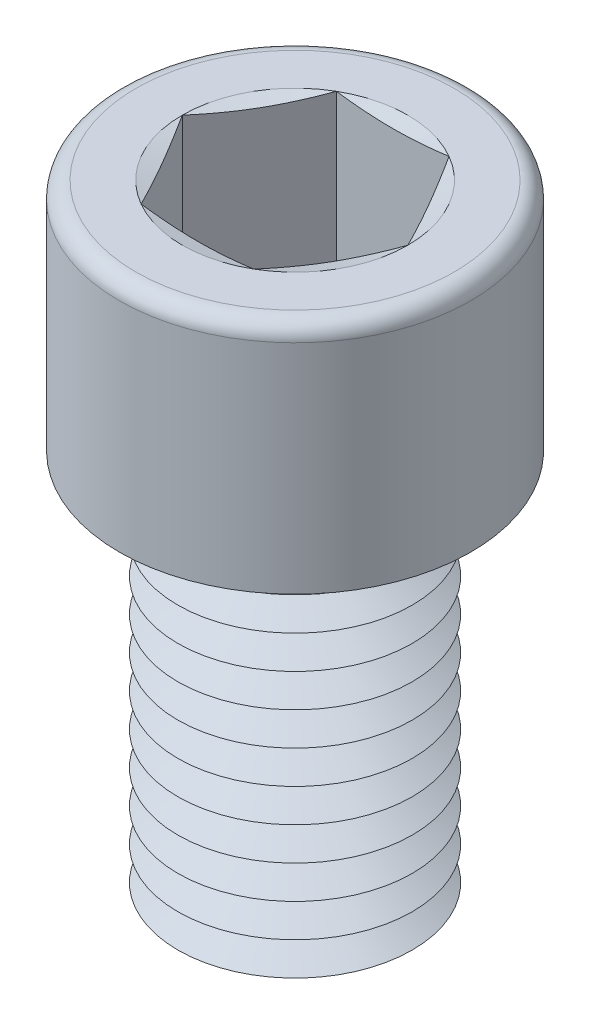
ISO-10303-21;
HEADER;
FILE_DESCRIPTION(('STEP AP214'),'2;1');
FILE_NAME('part.step','',(''),(''),'','','');
FILE_SCHEMA(('AUTOMOTIVE_DESIGN { 1 0 10303 214 1 1 1 1 }'));
ENDSEC;
DATA;
#1=APPLICATION_CONTEXT('core data for automotive mechanical design processes');
#2=APPLICATION_PROTOCOL_DEFINITION('international standard','automotive_design',2000,#1);
#3=PRODUCT_CONTEXT('',#1,'mechanical');
#4=PRODUCT('Part','Part','',(#3));
#5=PRODUCT_RELATED_PRODUCT_CATEGORY('part','',(#4));
#6=PRODUCT_DEFINITION_FORMATION('','',#4);
#7=PRODUCT_DEFINITION_CONTEXT('part definition',#1,'design');
#8=PRODUCT_DEFINITION('design','',#6,#7);
#9=PRODUCT_DEFINITION_SHAPE('','',#8);
#10=(LENGTH_UNIT() NAMED_UNIT(*) SI_UNIT(.MILLI.,.METRE.));
#11=(NAMED_UNIT(*) PLANE_ANGLE_UNIT() SI_UNIT($,.RADIAN.));
#12=(NAMED_UNIT(*) SI_UNIT($,.STERADIAN.) SOLID_ANGLE_UNIT());
#13=UNCERTAINTY_MEASURE_WITH_UNIT(LENGTH_MEASURE(1.E-05),#10,'distance_accuracy_value','');
#14=(GEOMETRIC_REPRESENTATION_CONTEXT(3) GLOBAL_UNCERTAINTY_ASSIGNED_CONTEXT((#13)) GLOBAL_UNIT_ASSIGNED_CONTEXT((#10,
#11,#12)) REPRESENTATION_CONTEXT('',''));
#15=CARTESIAN_POINT('',(0.,0.,0.));
#16=DIRECTION('',(0.,0.,1.));
#17=DIRECTION('',(1.,0.,0.));
#18=AXIS2_PLACEMENT_3D('',#15,#16,#17);
#19=CARTESIAN_POINT('',(0.,6.8,0.));
#20=DIRECTION('',(0.,1.,0.));
#21=DIRECTION('',(0.,0.,1.));
#22=AXIS2_PLACEMENT_3D('',#19,#20,#21);
#23=CONICAL_SURFACE('',#22,4.52775681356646,1.0471975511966);
#24=CARTESIAN_POINT('',(0.,7.65,0.));
#25=DIRECTION('',(0.,1.,0.));
#26=DIRECTION('',(0.,0.,1.));
#27=AXIS2_PLACEMENT_3D('',#24,#25,#26);
#28=CIRCLE('',#27,6.);
#29=CARTESIAN_POINT('',(0.,7.65,6.));
#30=VERTEX_POINT('',#29);
#31=EDGE_CURVE('E406',#30,#30,#28,.T.);
#32=ORIENTED_EDGE('',*,*,#31,.F.);
#33=EDGE_LOOP('',(#32));
#34=FACE_BOUND('',#33,.T.);
#35=CARTESIAN_POINT('',(0.,6.8,0.));
#36=DIRECTION('',(0.,1.,0.));
#37=DIRECTION('',(0.,0.,1.));
#38=AXIS2_PLACEMENT_3D('',#35,#36,#37);
#39=CIRCLE('',#38,4.52775681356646);
#40=CARTESIAN_POINT('',(0.,6.8,4.52775681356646));
#41=VERTEX_POINT('',#40);
#42=EDGE_CURVE('E409',#41,#41,#39,.T.);
#43=ORIENTED_EDGE('',*,*,#42,.T.);
#44=EDGE_LOOP('',(#43));
#45=FACE_BOUND('',#44,.T.);
#46=ADVANCED_FACE('F41',(#34,#45),#23,.T.);
#47=CARTESIAN_POINT('',(0.,5.95,0.));
#48=DIRECTION('',(0.,-1.,0.));
#49=DIRECTION('',(0.,0.,-1.));
#50=AXIS2_PLACEMENT_3D('',#47,#48,#49);
#51=CONICAL_SURFACE('',#50,6.,1.0471975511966);
#52=ORIENTED_EDGE('',*,*,#42,.F.);
#53=EDGE_LOOP('',(#52));
#54=FACE_BOUND('',#53,.T.);
#55=CARTESIAN_POINT('',(0.,5.95,0.));
#56=DIRECTION('',(0.,1.,0.));
#57=DIRECTION('',(0.,0.,1.));
#58=AXIS2_PLACEMENT_3D('',#55,#56,#57);
#59=CIRCLE('',#58,6.);
#60=CARTESIAN_POINT('',(0.,5.95,6.));
#61=VERTEX_POINT('',#60);
#62=EDGE_CURVE('E413',#61,#61,#59,.T.);
#63=ORIENTED_EDGE('',*,*,#62,.T.);
#64=EDGE_LOOP('',(#63));
#65=FACE_BOUND('',#64,.T.);
#66=ADVANCED_FACE('F250',(#54,#65),#51,.T.);
#67=CARTESIAN_POINT('',(0.,0.,0.));
#68=DIRECTION('',(0.,1.,0.));
#69=DIRECTION('',(0.,0.,1.));
#70=AXIS2_PLACEMENT_3D('',#67,#68,#69);
#71=PLANE('',#70);
#72=CARTESIAN_POINT('',(0.,0.,0.));
#73=DIRECTION('',(0.,1.,0.));
#74=DIRECTION('',(0.,0.,1.));
#75=AXIS2_PLACEMENT_3D('',#72,#73,#74);
#76=CIRCLE('',#75,4.52775681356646);
#77=CARTESIAN_POINT('',(0.,0.,4.52775681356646));
#78=VERTEX_POINT('',#77);
#79=EDGE_CURVE('E440',#78,#78,#76,.T.);
#80=ORIENTED_EDGE('',*,*,#79,.F.);
#81=EDGE_LOOP('',(#80));
#82=FACE_BOUND('',#81,.T.);
#83=ADVANCED_FACE('F247',(#82),#71,.F.);
#84=CARTESIAN_POINT('',(0.,0.,0.));
#85=DIRECTION('',(0.,1.,0.));
#86=DIRECTION('',(0.,0.,1.));
#87=AXIS2_PLACEMENT_3D('',#84,#85,#86);
#88=CONICAL_SURFACE('',#87,4.52775681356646,1.0471975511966);
#89=CARTESIAN_POINT('',(0.,0.85,0.));
#90=DIRECTION('',(0.,1.,0.));
#91=DIRECTION('',(0.,0.,1.));
#92=AXIS2_PLACEMENT_3D('',#89,#90,#91);
#93=CIRCLE('',#92,6.);
#94=CARTESIAN_POINT('',(0.,0.85,6.));
#95=VERTEX_POINT('',#94);
#96=EDGE_CURVE('E436',#95,#95,#93,.T.);
#97=ORIENTED_EDGE('',*,*,#96,.F.);
#98=EDGE_LOOP('',(#97));
#99=FACE_BOUND('',#98,.T.);
#100=ORIENTED_EDGE('',*,*,#79,.T.);
#101=EDGE_LOOP('',(#100));
#102=FACE_BOUND('',#101,.T.);
#103=ADVANCED_FACE('F249',(#99,#102),#88,.T.);
#104=CARTESIAN_POINT('',(0.,0.85,0.));
#105=DIRECTION('',(0.,-1.,0.));
#106=DIRECTION('',(0.,0.,-1.));
#107=AXIS2_PLACEMENT_3D('',#104,#105,#106);
#108=CONICAL_SURFACE('',#107,6.,1.0471975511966);
#109=CARTESIAN_POINT('',(0.,1.7,0.));
#110=DIRECTION('',(0.,1.,0.));
#111=DIRECTION('',(0.,0.,1.));
#112=AXIS2_PLACEMENT_3D('',#109,#110,#111);
#113=CIRCLE('',#112,4.52775681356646);
#114=CARTESIAN_POINT('',(0.,1.7,4.52775681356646));
#115=VERTEX_POINT('',#114);
#116=EDGE_CURVE('E432',#115,#115,#113,.T.);
#117=ORIENTED_EDGE('',*,*,#116,.F.);
#118=EDGE_LOOP('',(#117));
#119=FACE_BOUND('',#118,.T.);
#120=ORIENTED_EDGE('',*,*,#96,.T.);
#121=EDGE_LOOP('',(#120));
#122=FACE_BOUND('',#121,.T.);
#123=ADVANCED_FACE('F290',(#119,#122),#108,.T.);
#124=CARTESIAN_POINT('',(0.,1.7,0.));
#125=DIRECTION('',(0.,1.,0.));
#126=DIRECTION('',(0.,0.,1.));
#127=AXIS2_PLACEMENT_3D('',#124,#125,#126);
#128=CONICAL_SURFACE('',#127,4.52775681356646,1.0471975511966);
#129=CARTESIAN_POINT('',(0.,2.55,0.));
#130=DIRECTION('',(0.,1.,0.));
#131=DIRECTION('',(0.,0.,1.));
#132=AXIS2_PLACEMENT_3D('',#129,#130,#131);
#133=CIRCLE('',#132,6.);
#134=CARTESIAN_POINT('',(0.,2.55,6.));
#135=VERTEX_POINT('',#134);
#136=EDGE_CURVE('E428',#135,#135,#133,.T.);
#137=ORIENTED_EDGE('',*,*,#136,.F.);
#138=EDGE_LOOP('',(#137));
#139=FACE_BOUND('',#138,.T.);
#140=ORIENTED_EDGE('',*,*,#116,.T.);
#141=EDGE_LOOP('',(#140));
#142=FACE_BOUND('',#141,.T.);
#143=ADVANCED_FACE('F285',(#139,#142),#128,.T.);
#144=CARTESIAN_POINT('',(0.,2.55,0.));
#145=DIRECTION('',(0.,-1.,0.));
#146=DIRECTION('',(0.,0.,-1.));
#147=AXIS2_PLACEMENT_3D('',#144,#145,#146);
#148=CONICAL_SURFACE('',#147,6.,1.0471975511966);
#149=CARTESIAN_POINT('',(0.,3.4,0.));
#150=DIRECTION('',(0.,1.,0.));
#151=DIRECTION('',(0.,0.,1.));
#152=AXIS2_PLACEMENT_3D('',#149,#150,#151);
#153=CIRCLE('',#152,4.52775681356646);
#154=CARTESIAN_POINT('',(0.,3.4,4.52775681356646));
#155=VERTEX_POINT('',#154);
#156=EDGE_CURVE('E424',#155,#155,#153,.T.);
#157=ORIENTED_EDGE('',*,*,#156,.F.);
#158=EDGE_LOOP('',(#157));
#159=FACE_BOUND('',#158,.T.);
#160=ORIENTED_EDGE('',*,*,#136,.T.);
#161=EDGE_LOOP('',(#160));
#162=FACE_BOUND('',#161,.T.);
#163=ADVANCED_FACE('F282',(#159,#162),#148,.T.);
#164=CARTESIAN_POINT('',(0.,3.4,0.));
#165=DIRECTION('',(0.,1.,0.));
#166=DIRECTION('',(0.,0.,1.));
#167=AXIS2_PLACEMENT_3D('',#164,#165,#166);
#168=CONICAL_SURFACE('',#167,4.52775681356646,1.0471975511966);
#169=CARTESIAN_POINT('',(0.,4.25,0.));
#170=DIRECTION('',(0.,1.,0.));
#171=DIRECTION('',(0.,0.,1.));
#172=AXIS2_PLACEMENT_3D('',#169,#170,#171);
#173=CIRCLE('',#172,6.);
#174=CARTESIAN_POINT('',(0.,4.25,6.));
#175=VERTEX_POINT('',#174);
#176=EDGE_CURVE('E420',#175,#175,#173,.T.);
#177=ORIENTED_EDGE('',*,*,#176,.F.);
#178=EDGE_LOOP('',(#177));
#179=FACE_BOUND('',#178,.T.);
#180=ORIENTED_EDGE('',*,*,#156,.T.);
#181=EDGE_LOOP('',(#180));
#182=FACE_BOUND('',#181,.T.);
#183=ADVANCED_FACE('F276',(#179,#182),#168,.T.);
#184=CARTESIAN_POINT('',(0.,4.25,0.));
#185=DIRECTION('',(0.,-1.,0.));
#186=DIRECTION('',(0.,0.,-1.));
#187=AXIS2_PLACEMENT_3D('',#184,#185,#186);
#188=CONICAL_SURFACE('',#187,6.,1.0471975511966);
#189=CARTESIAN_POINT('',(0.,5.1,0.));
#190=DIRECTION('',(0.,1.,0.));
#191=DIRECTION('',(0.,0.,1.));
#192=AXIS2_PLACEMENT_3D('',#189,#190,#191);
#193=CIRCLE('',#192,4.52775681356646);
#194=CARTESIAN_POINT('',(0.,5.1,4.52775681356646));
#195=VERTEX_POINT('',#194);
#196=EDGE_CURVE('E416',#195,#195,#193,.T.);
#197=ORIENTED_EDGE('',*,*,#196,.F.);
#198=EDGE_LOOP('',(#197));
#199=FACE_BOUND('',#198,.T.);
#200=ORIENTED_EDGE('',*,*,#176,.T.);
#201=EDGE_LOOP('',(#200));
#202=FACE_BOUND('',#201,.T.);
#203=ADVANCED_FACE('F272',(#199,#202),#188,.T.);
#204=CARTESIAN_POINT('',(0.,5.1,0.));
#205=DIRECTION('',(0.,1.,0.));
#206=DIRECTION('',(0.,0.,1.));
#207=AXIS2_PLACEMENT_3D('',#204,#205,#206);
#208=CONICAL_SURFACE('',#207,4.52775681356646,1.0471975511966);
#209=ORIENTED_EDGE('',*,*,#62,.F.);
#210=EDGE_LOOP('',(#209));
#211=FACE_BOUND('',#210,.T.);
#212=ORIENTED_EDGE('',*,*,#196,.T.);
#213=EDGE_LOOP('',(#212));
#214=FACE_BOUND('',#213,.T.);
#215=ADVANCED_FACE('F275',(#211,#214),#208,.T.);
#216=CARTESIAN_POINT('',(0.,8.5,0.));
#217=DIRECTION('',(0.,1.,0.));
#218=DIRECTION('',(0.,0.,1.));
#219=AXIS2_PLACEMENT_3D('',#216,#217,#218);
#220=CONICAL_SURFACE('',#219,4.52775681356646,1.0471975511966);
#221=CARTESIAN_POINT('',(0.,9.35,0.));
#222=DIRECTION('',(0.,1.,0.));
#223=DIRECTION('',(0.,0.,1.));
#224=AXIS2_PLACEMENT_3D('',#221,#222,#223);
#225=CIRCLE('',#224,6.);
#226=CARTESIAN_POINT('',(0.,9.35,6.));
#227=VERTEX_POINT('',#226);
#228=EDGE_CURVE('E398',#227,#227,#225,.T.);
#229=ORIENTED_EDGE('',*,*,#228,.F.);
#230=EDGE_LOOP('',(#229));
#231=FACE_BOUND('',#230,.T.);
#232=CARTESIAN_POINT('',(0.,8.5,0.));
#233=DIRECTION('',(0.,1.,0.));
#234=DIRECTION('',(0.,0.,1.));
#235=AXIS2_PLACEMENT_3D('',#232,#233,#234);
#236=CIRCLE('',#235,4.52775681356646);
#237=CARTESIAN_POINT('',(0.,8.5,4.52775681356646));
#238=VERTEX_POINT('',#237);
#239=EDGE_CURVE('E402',#238,#238,#236,.T.);
#240=ORIENTED_EDGE('',*,*,#239,.T.);
#241=EDGE_LOOP('',(#240));
#242=FACE_BOUND('',#241,.T.);
#243=ADVANCED_FACE('F280',(#231,#242),#220,.T.);
#244=CARTESIAN_POINT('',(0.,7.65,0.));
#245=DIRECTION('',(0.,-1.,0.));
#246=DIRECTION('',(0.,0.,-1.));
#247=AXIS2_PLACEMENT_3D('',#244,#245,#246);
#248=CONICAL_SURFACE('',#247,6.,1.0471975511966);
#249=ORIENTED_EDGE('',*,*,#239,.F.);
#250=EDGE_LOOP('',(#249));
#251=FACE_BOUND('',#250,.T.);
#252=ORIENTED_EDGE('',*,*,#31,.T.);
#253=EDGE_LOOP('',(#252));
#254=FACE_BOUND('',#253,.T.);
#255=ADVANCED_FACE('F672',(#251,#254),#248,.T.);
#256=CARTESIAN_POINT('',(0.,10.2,0.));
#257=DIRECTION('',(0.,1.,0.));
#258=DIRECTION('',(0.,0.,1.));
#259=AXIS2_PLACEMENT_3D('',#256,#257,#258);
#260=CONICAL_SURFACE('',#259,4.52775681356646,1.0471975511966);
#261=CARTESIAN_POINT('',(0.,11.05,0.));
#262=DIRECTION('',(0.,1.,0.));
#263=DIRECTION('',(0.,0.,1.));
#264=AXIS2_PLACEMENT_3D('',#261,#262,#263);
#265=CIRCLE('',#264,6.);
#266=CARTESIAN_POINT('',(0.,11.05,6.));
#267=VERTEX_POINT('',#266);
#268=EDGE_CURVE('E390',#267,#267,#265,.T.);
#269=ORIENTED_EDGE('',*,*,#268,.F.);
#270=EDGE_LOOP('',(#269));
#271=FACE_BOUND('',#270,.T.);
#272=CARTESIAN_POINT('',(0.,10.2,0.));
#273=DIRECTION('',(0.,1.,0.));
#274=DIRECTION('',(0.,0.,1.));
#275=AXIS2_PLACEMENT_3D('',#272,#273,#274);
#276=CIRCLE('',#275,4.52775681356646);
#277=CARTESIAN_POINT('',(0.,10.2,4.52775681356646));
#278=VERTEX_POINT('',#277);
#279=EDGE_CURVE('E394',#278,#278,#276,.T.);
#280=ORIENTED_EDGE('',*,*,#279,.T.);
#281=EDGE_LOOP('',(#280));
#282=FACE_BOUND('',#281,.T.);
#283=ADVANCED_FACE('F681',(#271,#282),#260,.T.);
#284=CARTESIAN_POINT('',(0.,9.35,0.));
#285=DIRECTION('',(0.,-1.,0.));
#286=DIRECTION('',(0.,0.,-1.));
#287=AXIS2_PLACEMENT_3D('',#284,#285,#286);
#288=CONICAL_SURFACE('',#287,6.,1.0471975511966);
#289=ORIENTED_EDGE('',*,*,#279,.F.);
#290=EDGE_LOOP('',(#289));
#291=FACE_BOUND('',#290,.T.);
#292=ORIENTED_EDGE('',*,*,#228,.T.);
#293=EDGE_LOOP('',(#292));
#294=FACE_BOUND('',#293,.T.);
#295=ADVANCED_FACE('F691',(#291,#294),#288,.T.);
#296=CARTESIAN_POINT('',(0.,11.9,0.));
#297=DIRECTION('',(0.,1.,0.));
#298=DIRECTION('',(0.,0.,1.));
#299=AXIS2_PLACEMENT_3D('',#296,#297,#298);
#300=CONICAL_SURFACE('',#299,4.52775681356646,1.0471975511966);
#301=CARTESIAN_POINT('',(0.,12.75,0.));
#302=DIRECTION('',(0.,1.,0.));
#303=DIRECTION('',(0.,0.,1.));
#304=AXIS2_PLACEMENT_3D('',#301,#302,#303);
#305=CIRCLE('',#304,6.);
#306=CARTESIAN_POINT('',(0.,12.75,6.));
#307=VERTEX_POINT('',#306);
#308=EDGE_CURVE('E382',#307,#307,#305,.T.);
#309=ORIENTED_EDGE('',*,*,#308,.F.);
#310=EDGE_LOOP('',(#309));
#311=FACE_BOUND('',#310,.T.);
#312=CARTESIAN_POINT('',(0.,11.9,0.));
#313=DIRECTION('',(0.,1.,0.));
#314=DIRECTION('',(0.,0.,1.));
#315=AXIS2_PLACEMENT_3D('',#312,#313,#314);
#316=CIRCLE('',#315,4.52775681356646);
#317=CARTESIAN_POINT('',(0.,11.9,4.52775681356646));
#318=VERTEX_POINT('',#317);
#319=EDGE_CURVE('E386',#318,#318,#316,.T.);
#320=ORIENTED_EDGE('',*,*,#319,.T.);
#321=EDGE_LOOP('',(#320));
#322=FACE_BOUND('',#321,.T.);
#323=ADVANCED_FACE('F701',(#311,#322),#300,.T.);
#324=CARTESIAN_POINT('',(0.,11.05,0.));
#325=DIRECTION('',(0.,-1.,0.));
#326=DIRECTION('',(0.,0.,-1.));
#327=AXIS2_PLACEMENT_3D('',#324,#325,#326);
#328=CONICAL_SURFACE('',#327,6.,1.0471975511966);
#329=ORIENTED_EDGE('',*,*,#319,.F.);
#330=EDGE_LOOP('',(#329));
#331=FACE_BOUND('',#330,.T.);
#332=ORIENTED_EDGE('',*,*,#268,.T.);
#333=EDGE_LOOP('',(#332));
#334=FACE_BOUND('',#333,.T.);
#335=ADVANCED_FACE('F711',(#331,#334),#328,.T.);
#336=CARTESIAN_POINT('',(0.,13.6,0.));
#337=DIRECTION('',(0.,1.,0.));
#338=DIRECTION('',(0.,0.,1.));
#339=AXIS2_PLACEMENT_3D('',#336,#337,#338);
#340=CONICAL_SURFACE('',#339,4.52775681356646,1.0471975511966);
#341=CARTESIAN_POINT('',(0.,14.45,0.));
#342=DIRECTION('',(0.,1.,0.));
#343=DIRECTION('',(0.,0.,1.));
#344=AXIS2_PLACEMENT_3D('',#341,#342,#343);
#345=CIRCLE('',#344,6.);
#346=CARTESIAN_POINT('',(0.,14.45,6.));
#347=VERTEX_POINT('',#346);
#348=EDGE_CURVE('E374',#347,#347,#345,.T.);
#349=ORIENTED_EDGE('',*,*,#348,.F.);
#350=EDGE_LOOP('',(#349));
#351=FACE_BOUND('',#350,.T.);
#352=CARTESIAN_POINT('',(0.,13.6,0.));
#353=DIRECTION('',(0.,1.,0.));
#354=DIRECTION('',(0.,0.,1.));
#355=AXIS2_PLACEMENT_3D('',#352,#353,#354);
#356=CIRCLE('',#355,4.52775681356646);
#357=CARTESIAN_POINT('',(0.,13.6,4.52775681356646));
#358=VERTEX_POINT('',#357);
#359=EDGE_CURVE('E378',#358,#358,#356,.T.);
#360=ORIENTED_EDGE('',*,*,#359,.T.);
#361=EDGE_LOOP('',(#360));
#362=FACE_BOUND('',#361,.T.);
#363=ADVANCED_FACE('F721',(#351,#362),#340,.T.);
#364=CARTESIAN_POINT('',(0.,12.75,0.));
#365=DIRECTION('',(0.,-1.,0.));
#366=DIRECTION('',(0.,0.,-1.));
#367=AXIS2_PLACEMENT_3D('',#364,#365,#366);
#368=CONICAL_SURFACE('',#367,6.,1.0471975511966);
#369=ORIENTED_EDGE('',*,*,#359,.F.);
#370=EDGE_LOOP('',(#369));
#371=FACE_BOUND('',#370,.T.);
#372=ORIENTED_EDGE('',*,*,#308,.T.);
#373=EDGE_LOOP('',(#372));
#374=FACE_BOUND('',#373,.T.);
#375=ADVANCED_FACE('F731',(#371,#374),#368,.T.);
#376=CARTESIAN_POINT('',(0.,15.3,0.));
#377=DIRECTION('',(0.,1.,0.));
#378=DIRECTION('',(0.,0.,1.));
#379=AXIS2_PLACEMENT_3D('',#376,#377,#378);
#380=CONICAL_SURFACE('',#379,4.52775681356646,1.0471975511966);
#381=CARTESIAN_POINT('',(0.,16.15,0.));
#382=DIRECTION('',(0.,1.,0.));
#383=DIRECTION('',(0.,0.,1.));
#384=AXIS2_PLACEMENT_3D('',#381,#382,#383);
#385=CIRCLE('',#384,6.);
#386=CARTESIAN_POINT('',(0.,16.15,6.));
#387=VERTEX_POINT('',#386);
#388=EDGE_CURVE('E366',#387,#387,#385,.T.);
#389=ORIENTED_EDGE('',*,*,#388,.F.);
#390=EDGE_LOOP('',(#389));
#391=FACE_BOUND('',#390,.T.);
#392=CARTESIAN_POINT('',(0.,15.3,0.));
#393=DIRECTION('',(0.,1.,0.));
#394=DIRECTION('',(0.,0.,1.));
#395=AXIS2_PLACEMENT_3D('',#392,#393,#394);
#396=CIRCLE('',#395,4.52775681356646);
#397=CARTESIAN_POINT('',(0.,15.3,4.52775681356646));
#398=VERTEX_POINT('',#397);
#399=EDGE_CURVE('E370',#398,#398,#396,.T.);
#400=ORIENTED_EDGE('',*,*,#399,.T.);
#401=EDGE_LOOP('',(#400));
#402=FACE_BOUND('',#401,.T.);
#403=ADVANCED_FACE('F741',(#391,#402),#380,.T.);
#404=CARTESIAN_POINT('',(0.,14.45,0.));
#405=DIRECTION('',(0.,-1.,0.));
#406=DIRECTION('',(0.,0.,-1.));
#407=AXIS2_PLACEMENT_3D('',#404,#405,#406);
#408=CONICAL_SURFACE('',#407,6.,1.0471975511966);
#409=ORIENTED_EDGE('',*,*,#399,.F.);
#410=EDGE_LOOP('',(#409));
#411=FACE_BOUND('',#410,.T.);
#412=ORIENTED_EDGE('',*,*,#348,.T.);
#413=EDGE_LOOP('',(#412));
#414=FACE_BOUND('',#413,.T.);
#415=ADVANCED_FACE('F751',(#411,#414),#408,.T.);
#416=CARTESIAN_POINT('',(0.,17.,0.));
#417=DIRECTION('',(0.,1.,0.));
#418=DIRECTION('',(0.,0.,1.));
#419=AXIS2_PLACEMENT_3D('',#416,#417,#418);
#420=CONICAL_SURFACE('',#419,4.52775681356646,1.0471975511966);
#421=CARTESIAN_POINT('',(0.,17.85,0.));
#422=DIRECTION('',(0.,1.,0.));
#423=DIRECTION('',(0.,0.,1.));
#424=AXIS2_PLACEMENT_3D('',#421,#422,#423);
#425=CIRCLE('',#424,6.);
#426=CARTESIAN_POINT('',(0.,17.85,6.));
#427=VERTEX_POINT('',#426);
#428=EDGE_CURVE('E351',#427,#427,#425,.T.);
#429=ORIENTED_EDGE('',*,*,#428,.F.);
#430=EDGE_LOOP('',(#429));
#431=FACE_BOUND('',#430,.T.);
#432=CARTESIAN_POINT('',(0.,17.,0.));
#433=DIRECTION('',(0.,1.,0.));
#434=DIRECTION('',(0.,0.,1.));
#435=AXIS2_PLACEMENT_3D('',#432,#433,#434);
#436=CIRCLE('',#435,4.52775681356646);
#437=CARTESIAN_POINT('',(0.,17.,4.52775681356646));
#438=VERTEX_POINT('',#437);
#439=EDGE_CURVE('E362',#438,#438,#436,.T.);
#440=ORIENTED_EDGE('',*,*,#439,.T.);
#441=EDGE_LOOP('',(#440));
#442=FACE_BOUND('',#441,.T.);
#443=ADVANCED_FACE('F761',(#431,#442),#420,.T.);
#444=CARTESIAN_POINT('',(0.,16.15,0.));
#445=DIRECTION('',(0.,-1.,0.));
#446=DIRECTION('',(0.,0.,-1.));
#447=AXIS2_PLACEMENT_3D('',#444,#445,#446);
#448=CONICAL_SURFACE('',#447,6.,1.0471975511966);
#449=ORIENTED_EDGE('',*,*,#439,.F.);
#450=EDGE_LOOP('',(#449));
#451=FACE_BOUND('',#450,.T.);
#452=ORIENTED_EDGE('',*,*,#388,.T.);
#453=EDGE_LOOP('',(#452));
#454=FACE_BOUND('',#453,.T.);
#455=ADVANCED_FACE('F771',(#451,#454),#448,.T.);
#456=CARTESIAN_POINT('',(0.,18.7,0.));
#457=DIRECTION('',(0.,1.,0.));
#458=DIRECTION('',(0.,0.,1.));
#459=AXIS2_PLACEMENT_3D('',#456,#457,#458);
#460=CONICAL_SURFACE('',#459,4.52775681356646,1.0471975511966);
#461=CARTESIAN_POINT('',(0.,19.55,0.));
#462=DIRECTION('',(0.,1.,0.));
#463=DIRECTION('',(0.,0.,1.));
#464=AXIS2_PLACEMENT_3D('',#461,#462,#463);
#465=CIRCLE('',#464,6.);
#466=CARTESIAN_POINT('',(0.,19.55,6.));
#467=VERTEX_POINT('',#466);
#468=EDGE_CURVE('E357',#467,#467,#465,.T.);
#469=ORIENTED_EDGE('',*,*,#468,.F.);
#470=EDGE_LOOP('',(#469));
#471=FACE_BOUND('',#470,.T.);
#472=CARTESIAN_POINT('',(0.,18.7,0.));
#473=DIRECTION('',(0.,1.,0.));
#474=DIRECTION('',(0.,0.,1.));
#475=AXIS2_PLACEMENT_3D('',#472,#473,#474);
#476=CIRCLE('',#475,4.52775681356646);
#477=CARTESIAN_POINT('',(0.,18.7,4.52775681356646));
#478=VERTEX_POINT('',#477);
#479=EDGE_CURVE('E347',#478,#478,#476,.T.);
#480=ORIENTED_EDGE('',*,*,#479,.T.);
#481=EDGE_LOOP('',(#480));
#482=FACE_BOUND('',#481,.T.);
#483=ADVANCED_FACE('F781',(#471,#482),#460,.T.);
#484=CARTESIAN_POINT('',(0.,17.85,0.));
#485=DIRECTION('',(0.,-1.,0.));
#486=DIRECTION('',(0.,0.,-1.));
#487=AXIS2_PLACEMENT_3D('',#484,#485,#486);
#488=CONICAL_SURFACE('',#487,6.,1.0471975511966);
#489=ORIENTED_EDGE('',*,*,#479,.F.);
#490=EDGE_LOOP('',(#489));
#491=FACE_BOUND('',#490,.T.);
#492=ORIENTED_EDGE('',*,*,#428,.T.);
#493=EDGE_LOOP('',(#492));
#494=FACE_BOUND('',#493,.T.);
#495=ADVANCED_FACE('F194',(#491,#494),#488,.T.);
#496=CARTESIAN_POINT('',(0.,32.,0.));
#497=DIRECTION('',(0.,1.,0.));
#498=DIRECTION('',(0.,0.,1.));
#499=AXIS2_PLACEMENT_3D('',#496,#497,#498);
#500=PLANE('',#499);
#501=CARTESIAN_POINT('',(0.,32.,0.));
#502=DIRECTION('',(0.,1.,0.));
#503=DIRECTION('',(0.,0.,1.));
#504=AXIS2_PLACEMENT_3D('',#501,#502,#503);
#505=CIRCLE('',#504,5.77350269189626);
#506=CARTESIAN_POINT('',(2.88675134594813,32.,5.));
#507=VERTEX_POINT('',#506);
#508=CARTESIAN_POINT('',(5.77350269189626,32.,0.));
#509=VERTEX_POINT('',#508);
#510=EDGE_CURVE('E121',#507,#509,#505,.T.);
#511=ORIENTED_EDGE('',*,*,#510,.F.);
#512=CARTESIAN_POINT('',(0.,32.,0.));
#513=DIRECTION('',(0.,1.,0.));
#514=DIRECTION('',(0.,0.,1.));
#515=AXIS2_PLACEMENT_3D('',#512,#513,#514);
#516=CIRCLE('',#515,5.77350269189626);
#517=CARTESIAN_POINT('',(-2.88675134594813,32.,5.));
#518=VERTEX_POINT('',#517);
#519=EDGE_CURVE('E45',#518,#507,#516,.T.);
#520=ORIENTED_EDGE('',*,*,#519,.F.);
#521=CARTESIAN_POINT('',(-5.77350269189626,32.,0.));
#522=VERTEX_POINT('',#521);
#523=EDGE_CURVE('E138',#522,#518,#516,.T.);
#524=ORIENTED_EDGE('',*,*,#523,.F.);
#525=CARTESIAN_POINT('',(-2.88675134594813,32.,-5.));
#526=VERTEX_POINT('',#525);
#527=EDGE_CURVE('E513',#526,#522,#516,.T.);
#528=ORIENTED_EDGE('',*,*,#527,.F.);
#529=CARTESIAN_POINT('',(2.88675134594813,32.,-5.));
#530=VERTEX_POINT('',#529);
#531=EDGE_CURVE('E51',#530,#526,#516,.T.);
#532=ORIENTED_EDGE('',*,*,#531,.F.);
#533=EDGE_CURVE('E11',#509,#530,#516,.T.);
#534=ORIENTED_EDGE('',*,*,#533,.F.);
#535=EDGE_LOOP('',(#511,#520,#524,#528,#532,#534));
#536=FACE_BOUND('',#535,.T.);
#537=CARTESIAN_POINT('',(0.,32.,0.));
#538=DIRECTION('',(0.,1.,0.));
#539=DIRECTION('',(0.,0.,1.));
#540=AXIS2_PLACEMENT_3D('',#537,#538,#539);
#541=CIRCLE('',#540,8.15);
#542=CARTESIAN_POINT('',(0.,32.,8.15));
#543=VERTEX_POINT('',#542);
#544=EDGE_CURVE('E484',#543,#543,#541,.T.);
#545=ORIENTED_EDGE('',*,*,#544,.T.);
#546=EDGE_LOOP('',(#545));
#547=FACE_BOUND('',#546,.T.);
#548=ADVANCED_FACE('F140',(#536,#547),#500,.T.);
#549=CARTESIAN_POINT('',(0.,31.15,0.));
#550=DIRECTION('',(0.,1.,0.));
#551=DIRECTION('',(0.,0.,1.));
#552=AXIS2_PLACEMENT_3D('',#549,#550,#551);
#553=TOROIDAL_SURFACE('',#552,8.15,0.85);
#554=CARTESIAN_POINT('',(0.,31.15,0.));
#555=DIRECTION('',(0.,1.,0.));
#556=DIRECTION('',(0.,0.,1.));
#557=AXIS2_PLACEMENT_3D('',#554,#555,#556);
#558=CIRCLE('',#557,9.);
#559=CARTESIAN_POINT('',(0.,31.15,9.));
#560=VERTEX_POINT('',#559);
#561=EDGE_CURVE('E488',#560,#560,#558,.F.);
#562=ORIENTED_EDGE('',*,*,#561,.F.);
#563=EDGE_LOOP('',(#562));
#564=FACE_BOUND('',#563,.T.);
#565=ORIENTED_EDGE('',*,*,#544,.F.);
#566=EDGE_LOOP('',(#565));
#567=FACE_BOUND('',#566,.T.);
#568=ADVANCED_FACE('F43',(#564,#567),#553,.T.);
#569=CARTESIAN_POINT('',(0.,32.,0.));
#570=DIRECTION('',(0.,-1.,0.));
#571=DIRECTION('',(0.,0.,-1.));
#572=AXIS2_PLACEMENT_3D('',#569,#570,#571);
#573=CYLINDRICAL_SURFACE('',#572,9.);
#574=ORIENTED_EDGE('',*,*,#561,.T.);
#575=EDGE_LOOP('',(#574));
#576=FACE_BOUND('',#575,.T.);
#577=CARTESIAN_POINT('',(0.,20.,0.));
#578=DIRECTION('',(0.,1.,0.));
#579=DIRECTION('',(0.,0.,1.));
#580=AXIS2_PLACEMENT_3D('',#577,#578,#579);
#581=CIRCLE('',#580,9.);
#582=CARTESIAN_POINT('',(0.,20.,9.));
#583=VERTEX_POINT('',#582);
#584=EDGE_CURVE('E471',#583,#583,#581,.T.);
#585=ORIENTED_EDGE('',*,*,#584,.T.);
#586=EDGE_LOOP('',(#585));
#587=FACE_BOUND('',#586,.T.);
#588=ADVANCED_FACE('F242',(#576,#587),#573,.T.);
#589=CARTESIAN_POINT('',(0.,20.,0.));
#590=DIRECTION('',(0.,1.,0.));
#591=DIRECTION('',(0.,0.,1.));
#592=AXIS2_PLACEMENT_3D('',#589,#590,#591);
#593=PLANE('',#592);
#594=ORIENTED_EDGE('',*,*,#584,.F.);
#595=EDGE_LOOP('',(#594));
#596=FACE_BOUND('',#595,.T.);
#597=CARTESIAN_POINT('',(0.,20.,0.));
#598=DIRECTION('',(0.,1.,0.));
#599=DIRECTION('',(0.,0.,1.));
#600=AXIS2_PLACEMENT_3D('',#597,#598,#599);
#601=CIRCLE('',#600,6.);
#602=CARTESIAN_POINT('',(0.,20.,6.));
#603=VERTEX_POINT('',#602);
#604=EDGE_CURVE('E480',#603,#603,#601,.T.);
#605=ORIENTED_EDGE('',*,*,#604,.T.);
#606=EDGE_LOOP('',(#605));
#607=FACE_BOUND('',#606,.T.);
#608=ADVANCED_FACE('F238',(#596,#607),#593,.F.);
#609=CARTESIAN_POINT('',(0.,20.,0.));
#610=DIRECTION('',(0.,-1.,0.));
#611=DIRECTION('',(0.,0.,-1.));
#612=AXIS2_PLACEMENT_3D('',#609,#610,#611);
#613=CYLINDRICAL_SURFACE('',#612,6.);
#614=ORIENTED_EDGE('',*,*,#468,.T.);
#615=EDGE_LOOP('',(#614));
#616=FACE_BOUND('',#615,.T.);
#617=ORIENTED_EDGE('',*,*,#604,.F.);
#618=EDGE_LOOP('',(#617));
#619=FACE_BOUND('',#618,.T.);
#620=ADVANCED_FACE('F241',(#616,#619),#613,.T.);
#621=CARTESIAN_POINT('',(0.,32.,0.));
#622=DIRECTION('',(0.,1.,0.));
#623=DIRECTION('',(0.,0.,1.));
#624=AXIS2_PLACEMENT_3D('',#621,#622,#623);
#625=CONICAL_SURFACE('',#624,5.77350269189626,1.30899693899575);
#626=ORIENTED_EDGE('',*,*,#519,.T.);
#627=CARTESIAN_POINT('',(-7.53601896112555,32.8762922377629,5.));
#628=CARTESIAN_POINT('',(-7.31024491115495,32.8258964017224,5.));
#629=CARTESIAN_POINT('',(-7.08432679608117,32.7761341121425,5.));
#630=CARTESIAN_POINT('',(-6.6321318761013,32.6782185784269,5.));
#631=CARTESIAN_POINT('',(-6.40585505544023,32.6300654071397,5.));
#632=CARTESIAN_POINT('',(-5.95265829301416,32.5356658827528,5.));
#633=CARTESIAN_POINT('',(-5.72573792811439,32.4894215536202,5.));
#634=CARTESIAN_POINT('',(-5.27141735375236,32.3993548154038,5.));
#635=CARTESIAN_POINT('',(-5.04401714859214,32.3555323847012,5.));
#636=CARTESIAN_POINT('',(-4.59062882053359,32.2712514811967,5.));
#637=CARTESIAN_POINT('',(-4.36464552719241,32.2307671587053,5.));
#638=CARTESIAN_POINT('',(-3.91205719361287,32.1534441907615,5.));
#639=CARTESIAN_POINT('',(-3.68545216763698,32.1166054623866,5.));
#640=CARTESIAN_POINT('',(-3.23158610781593,32.0474235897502,5.));
#641=CARTESIAN_POINT('',(-3.0043251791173,32.0150797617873,5.));
#642=CARTESIAN_POINT('',(-2.54908400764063,31.9558588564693,5.));
#643=CARTESIAN_POINT('',(-2.32110376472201,31.9289817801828,5.));
#644=CARTESIAN_POINT('',(-1.86187954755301,31.8814746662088,5.));
#645=CARTESIAN_POINT('',(-1.63062780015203,31.8609186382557,5.));
#646=CARTESIAN_POINT('',(-1.16756520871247,31.827486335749,5.));
#647=CARTESIAN_POINT('',(-0.935754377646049,31.8146098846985,5.));
#648=CARTESIAN_POINT('',(-0.471911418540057,31.7972884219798,5.));
#649=CARTESIAN_POINT('',(-0.239879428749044,31.7928397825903,5.));
#650=CARTESIAN_POINT('',(0.224188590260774,31.7926446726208,5.));
#651=CARTESIAN_POINT('',(0.456224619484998,31.7968982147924,5.));
#652=CARTESIAN_POINT('',(0.920927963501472,31.8138725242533,5.));
#653=CARTESIAN_POINT('',(1.15359399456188,31.826627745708,5.));
#654=CARTESIAN_POINT('',(1.61837361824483,31.8598918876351,5.));
#655=CARTESIAN_POINT('',(1.85048718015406,31.8804012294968,5.));
#656=CARTESIAN_POINT('',(2.31415649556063,31.9281624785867,5.));
#657=CARTESIAN_POINT('',(2.54571180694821,31.9554186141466,5.));
#658=CARTESIAN_POINT('',(3.00808011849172,32.0155697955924,5.));
#659=CARTESIAN_POINT('',(3.23889311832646,32.048464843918,5.));
#660=CARTESIAN_POINT('',(3.70583783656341,32.1197908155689,5.));
#661=CARTESIAN_POINT('',(3.94195070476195,32.1583440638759,5.));
#662=CARTESIAN_POINT('',(4.41350709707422,32.2393601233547,5.));
#663=CARTESIAN_POINT('',(4.6489506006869,32.2818230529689,5.));
#664=CARTESIAN_POINT('',(5.11927632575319,32.3698836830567,5.));
#665=CARTESIAN_POINT('',(5.35415847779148,32.4154817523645,5.));
#666=CARTESIAN_POINT('',(5.82342156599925,32.5091942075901,5.));
#667=CARTESIAN_POINT('',(6.05780249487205,32.5573086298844,5.));
#668=CARTESIAN_POINT('',(6.76045918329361,32.7046977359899,5.));
#669=CARTESIAN_POINT('',(7.22810106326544,32.8069899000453,5.));
#670=CARTESIAN_POINT('',(8.16214602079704,33.0168686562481,5.));
#671=CARTESIAN_POINT('',(8.62854918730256,33.1244548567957,5.));
#672=CARTESIAN_POINT('',(9.55483040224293,33.3419500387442,5.));
#673=CARTESIAN_POINT('',(10.0147188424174,33.4518148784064,5.));
#674=CARTESIAN_POINT('',(10.9338908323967,33.6740840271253,5.));
#675=CARTESIAN_POINT('',(11.3931743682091,33.78648839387,5.));
#676=CARTESIAN_POINT('',(12.3106437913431,34.0129904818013,5.));
#677=CARTESIAN_POINT('',(12.7688303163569,34.1270856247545,5.));
#678=CARTESIAN_POINT('',(13.6848325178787,34.3566862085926,5.));
#679=CARTESIAN_POINT('',(14.142648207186,34.4721915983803,5.));
#680=CARTESIAN_POINT('',(14.6003379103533,34.5881883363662,5.));
#681=B_SPLINE_CURVE_WITH_KNOTS('',3,(#627,#628,#629,#630,#631,#632,#633,#634,#635,#636,#637,
#638,#639,#640,#641,#642,#643,#644,#645,#646,#647,#648,#649,#650,#651,#652,#653,#654,#655,#656,
#657,#658,#659,#660,#661,#662,#663,#664,#665,#666,#667,#668,#669,#670,#671,#672,#673,#674,#675,
#676,#677,#678,#679,#680),.UNSPECIFIED.,.F.,.F.,(4,2,2,2,2,2,2,2,2,2,2,2,2,2,2,2,2,2,2,2,2,2,2,
2,2,2,4),(0.,0.693993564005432,1.38801850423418,2.08276135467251,2.7774980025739,
3.46621708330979,4.15492049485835,4.8435190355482,5.5321177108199,6.228496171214,
6.9248586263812,7.62092126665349,8.31698492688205,9.01588676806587,9.71482659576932,
10.4142055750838,11.113584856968,11.8312632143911,12.5489633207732,13.2667480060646,
13.9845430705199,15.4205845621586,16.85651998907,18.2749978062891,19.6935078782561,
21.1100410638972,22.5265230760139),.UNSPECIFIED.);
#682=EDGE_CURVE('E127',#518,#507,#681,.T.);
#683=ORIENTED_EDGE('',*,*,#682,.F.);
#684=EDGE_LOOP('',(#626,#683));
#685=FACE_BOUND('',#684,.T.);
#686=ADVANCED_FACE('F132',(#685),#625,.F.);
#687=ORIENTED_EDGE('',*,*,#523,.T.);
#688=CARTESIAN_POINT('',(-5.7736181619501,32.0000309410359,-0.000200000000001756));
#689=CARTESIAN_POINT('',(-5.65372906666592,31.9678926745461,0.207454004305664));
#690=CARTESIAN_POINT('',(-5.53362259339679,31.9387163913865,0.415484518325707));
#691=CARTESIAN_POINT('',(-5.29298546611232,31.8874563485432,0.832280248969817));
#692=CARTESIAN_POINT('',(-5.17245465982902,31.8653754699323,1.04104572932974));
#693=CARTESIAN_POINT('',(-4.93169967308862,31.8295953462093,1.45804559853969));
#694=CARTESIAN_POINT('',(-4.81147712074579,31.8158534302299,1.66627716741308));
#695=CARTESIAN_POINT('',(-4.57087869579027,31.7974269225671,2.08300586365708));
#696=CARTESIAN_POINT('',(-4.45050285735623,31.7927405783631,2.29150293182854));
#697=CARTESIAN_POINT('',(-4.20975118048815,31.7927405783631,2.70849706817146));
#698=CARTESIAN_POINT('',(-4.08937534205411,31.7974269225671,2.91699413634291));
#699=CARTESIAN_POINT('',(-3.8487769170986,31.8158534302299,3.33372283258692));
#700=CARTESIAN_POINT('',(-3.72855436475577,31.8295953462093,3.54195440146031));
#701=CARTESIAN_POINT('',(-3.48779937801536,31.8653754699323,3.95895427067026));
#702=CARTESIAN_POINT('',(-3.36726857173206,31.8874563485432,4.16771975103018));
#703=CARTESIAN_POINT('',(-3.1266314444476,31.9387163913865,4.58451548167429));
#704=CARTESIAN_POINT('',(-3.00652497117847,31.9678926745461,4.79254599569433));
#705=CARTESIAN_POINT('',(-2.88663587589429,32.0000309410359,5.0002));
#706=B_SPLINE_CURVE_WITH_KNOTS('',3,(#688,#689,#690,#691,#692,#693,#694,#695,#696,#697,#698,
#699,#700,#701,#702,#703,#704,#705),.UNSPECIFIED.,.F.,.F.,(4,2,2,2,2,2,2,2,4),(0.,
0.725805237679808,1.45190481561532,2.17425686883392,2.89646911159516,3.6186813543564,
4.34103340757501,5.06713298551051,5.79293822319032),.UNSPECIFIED.);
#707=EDGE_CURVE('E163',#522,#518,#706,.T.);
#708=ORIENTED_EDGE('',*,*,#707,.F.);
#709=EDGE_LOOP('',(#687,#708));
#710=FACE_BOUND('',#709,.T.);
#711=ADVANCED_FACE('F257',(#710),#625,.F.);
#712=ORIENTED_EDGE('',*,*,#527,.T.);
#713=CARTESIAN_POINT('',(-2.88663587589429,32.0000309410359,-5.0002));
#714=CARTESIAN_POINT('',(-3.00652497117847,31.9678926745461,-4.79254599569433));
#715=CARTESIAN_POINT('',(-3.1266314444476,31.9387163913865,-4.58451548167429));
#716=CARTESIAN_POINT('',(-3.36726857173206,31.8874563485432,-4.16771975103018));
#717=CARTESIAN_POINT('',(-3.48779937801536,31.8653754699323,-3.95895427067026));
#718=CARTESIAN_POINT('',(-3.72855436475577,31.8295953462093,-3.54195440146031));
#719=CARTESIAN_POINT('',(-3.8487769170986,31.8158534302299,-3.33372283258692));
#720=CARTESIAN_POINT('',(-4.08937534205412,31.797426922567,-2.91699413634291));
#721=CARTESIAN_POINT('',(-4.20975118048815,31.7927405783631,-2.70849706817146));
#722=CARTESIAN_POINT('',(-4.45050285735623,31.7927405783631,-2.29150293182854));
#723=CARTESIAN_POINT('',(-4.57087869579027,31.797426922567,-2.08300586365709));
#724=CARTESIAN_POINT('',(-4.81147712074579,31.8158534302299,-1.66627716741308));
#725=CARTESIAN_POINT('',(-4.93169967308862,31.8295953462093,-1.45804559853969));
#726=CARTESIAN_POINT('',(-5.17245465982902,31.8653754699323,-1.04104572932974));
#727=CARTESIAN_POINT('',(-5.29298546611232,31.8874563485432,-0.832280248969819));
#728=CARTESIAN_POINT('',(-5.53362259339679,31.9387163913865,-0.415484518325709));
#729=CARTESIAN_POINT('',(-5.65372906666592,31.9678926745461,-0.207454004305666));
#730=CARTESIAN_POINT('',(-5.7736181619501,32.0000309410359,0.000199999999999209));
#731=B_SPLINE_CURVE_WITH_KNOTS('',3,(#713,#714,#715,#716,#717,#718,#719,#720,#721,#722,#723,
#724,#725,#726,#727,#728,#729,#730),.UNSPECIFIED.,.F.,.F.,(4,2,2,2,2,2,2,2,4),(0.,
0.725805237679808,1.45190481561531,2.17425686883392,2.89646911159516,3.6186813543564,
4.341033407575,5.06713298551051,5.79293822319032),.UNSPECIFIED.);
#732=EDGE_CURVE('E63',#526,#522,#731,.T.);
#733=ORIENTED_EDGE('',*,*,#732,.F.);
#734=EDGE_LOOP('',(#712,#733));
#735=FACE_BOUND('',#734,.T.);
#736=ADVANCED_FACE('F192',(#735),#625,.F.);
#737=ORIENTED_EDGE('',*,*,#531,.T.);
#738=CARTESIAN_POINT('',(-7.53601896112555,32.8762922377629,-5.));
#739=CARTESIAN_POINT('',(-7.31024491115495,32.8258964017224,-5.));
#740=CARTESIAN_POINT('',(-7.08432679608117,32.7761341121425,-5.));
#741=CARTESIAN_POINT('',(-6.63213187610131,32.6782185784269,-5.));
#742=CARTESIAN_POINT('',(-6.40585505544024,32.6300654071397,-5.));
#743=CARTESIAN_POINT('',(-5.95265829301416,32.5356658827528,-5.));
#744=CARTESIAN_POINT('',(-5.7257379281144,32.4894215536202,-5.));
#745=CARTESIAN_POINT('',(-5.27141735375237,32.3993548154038,-5.));
#746=CARTESIAN_POINT('',(-5.04401714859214,32.3555323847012,-5.));
#747=CARTESIAN_POINT('',(-4.5906288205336,32.2712514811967,-5.));
#748=CARTESIAN_POINT('',(-4.36464552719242,32.2307671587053,-5.));
#749=CARTESIAN_POINT('',(-3.91205719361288,32.1534441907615,-5.));
#750=CARTESIAN_POINT('',(-3.68545216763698,32.1166054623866,-5.));
#751=CARTESIAN_POINT('',(-3.23158610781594,32.0474235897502,-5.));
#752=CARTESIAN_POINT('',(-3.00432517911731,32.0150797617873,-5.));
#753=CARTESIAN_POINT('',(-2.54908400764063,31.9558588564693,-5.));
#754=CARTESIAN_POINT('',(-2.32110376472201,31.9289817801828,-5.));
#755=CARTESIAN_POINT('',(-1.86187954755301,31.8814746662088,-5.));
#756=CARTESIAN_POINT('',(-1.63062780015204,31.8609186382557,-5.));
#757=CARTESIAN_POINT('',(-1.16756520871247,31.827486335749,-5.));
#758=CARTESIAN_POINT('',(-0.935754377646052,31.8146098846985,-5.));
#759=CARTESIAN_POINT('',(-0.47191141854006,31.7972884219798,-5.));
#760=CARTESIAN_POINT('',(-0.239879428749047,31.7928397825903,-5.));
#761=CARTESIAN_POINT('',(0.224188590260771,31.7926446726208,-5.));
#762=CARTESIAN_POINT('',(0.456224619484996,31.7968982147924,-5.));
#763=CARTESIAN_POINT('',(0.920927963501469,31.8138725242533,-5.));
#764=CARTESIAN_POINT('',(1.15359399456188,31.826627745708,-5.));
#765=CARTESIAN_POINT('',(1.61837361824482,31.8598918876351,-5.));
#766=CARTESIAN_POINT('',(1.85048718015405,31.8804012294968,-5.));
#767=CARTESIAN_POINT('',(2.31415649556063,31.9281624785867,-5.));
#768=CARTESIAN_POINT('',(2.54571180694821,31.9554186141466,-5.));
#769=CARTESIAN_POINT('',(3.00808011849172,32.0155697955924,-5.));
#770=CARTESIAN_POINT('',(3.23889311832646,32.048464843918,-5.));
#771=CARTESIAN_POINT('',(3.70583783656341,32.1197908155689,-5.));
#772=CARTESIAN_POINT('',(3.94195070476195,32.1583440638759,-5.));
#773=CARTESIAN_POINT('',(4.41350709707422,32.2393601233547,-5.));
#774=CARTESIAN_POINT('',(4.6489506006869,32.2818230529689,-5.));
#775=CARTESIAN_POINT('',(5.11927632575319,32.3698836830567,-5.));
#776=CARTESIAN_POINT('',(5.35415847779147,32.4154817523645,-5.));
#777=CARTESIAN_POINT('',(5.82342156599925,32.5091942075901,-5.));
#778=CARTESIAN_POINT('',(6.05780249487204,32.5573086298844,-5.));
#779=CARTESIAN_POINT('',(6.76045918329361,32.7046977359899,-5.));
#780=CARTESIAN_POINT('',(7.22810106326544,32.8069899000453,-5.));
#781=CARTESIAN_POINT('',(8.16214602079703,33.0168686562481,-5.));
#782=CARTESIAN_POINT('',(8.62854918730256,33.1244548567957,-5.));
#783=CARTESIAN_POINT('',(9.55483040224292,33.3419500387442,-5.));
#784=CARTESIAN_POINT('',(10.0147188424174,33.4518148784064,-5.));
#785=CARTESIAN_POINT('',(10.9338908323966,33.6740840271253,-5.));
#786=CARTESIAN_POINT('',(11.3931743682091,33.78648839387,-5.));
#787=CARTESIAN_POINT('',(12.3106437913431,34.0129904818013,-5.));
#788=CARTESIAN_POINT('',(12.7688303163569,34.1270856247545,-5.));
#789=CARTESIAN_POINT('',(13.6848325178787,34.3566862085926,-5.));
#790=CARTESIAN_POINT('',(14.142648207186,34.4721915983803,-5.));
#791=CARTESIAN_POINT('',(14.6003379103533,34.5881883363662,-5.));
#792=B_SPLINE_CURVE_WITH_KNOTS('',3,(#738,#739,#740,#741,#742,#743,#744,#745,#746,#747,#748,
#749,#750,#751,#752,#753,#754,#755,#756,#757,#758,#759,#760,#761,#762,#763,#764,#765,#766,#767,
#768,#769,#770,#771,#772,#773,#774,#775,#776,#777,#778,#779,#780,#781,#782,#783,#784,#785,#786,
#787,#788,#789,#790,#791),.UNSPECIFIED.,.F.,.F.,(4,2,2,2,2,2,2,2,2,2,2,2,2,2,2,2,2,2,2,2,2,2,2,
2,2,2,4),(0.,0.693993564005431,1.38801850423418,2.08276135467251,2.77749800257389,
3.46621708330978,4.15492049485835,4.8435190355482,5.5321177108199,6.228496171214,
6.9248586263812,7.62092126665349,8.31698492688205,9.01588676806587,9.71482659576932,
10.4142055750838,11.113584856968,11.8312632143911,12.5489633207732,13.2667480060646,
13.9845430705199,15.4205845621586,16.8565199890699,18.2749978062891,19.6935078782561,
21.1100410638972,22.5265230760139),.UNSPECIFIED.);
#793=EDGE_CURVE('E213',#530,#526,#792,.F.);
#794=ORIENTED_EDGE('',*,*,#793,.F.);
#795=EDGE_LOOP('',(#737,#794));
#796=FACE_BOUND('',#795,.T.);
#797=ADVANCED_FACE('F187',(#796),#625,.F.);
#798=ORIENTED_EDGE('',*,*,#533,.T.);
#799=CARTESIAN_POINT('',(5.7736181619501,32.0000309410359,0.000200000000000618));
#800=CARTESIAN_POINT('',(5.65372906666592,31.9678926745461,-0.207454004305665));
#801=CARTESIAN_POINT('',(5.53362259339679,31.9387163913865,-0.415484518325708));
#802=CARTESIAN_POINT('',(5.29298546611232,31.8874563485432,-0.832280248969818));
#803=CARTESIAN_POINT('',(5.17245465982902,31.8653754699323,-1.04104572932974));
#804=CARTESIAN_POINT('',(4.93169967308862,31.8295953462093,-1.45804559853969));
#805=CARTESIAN_POINT('',(4.81147712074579,31.8158534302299,-1.66627716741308));
#806=CARTESIAN_POINT('',(4.57087869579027,31.7974269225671,-2.08300586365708));
#807=CARTESIAN_POINT('',(4.45050285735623,31.7927405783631,-2.29150293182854));
#808=CARTESIAN_POINT('',(4.20975118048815,31.7927405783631,-2.70849706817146));
#809=CARTESIAN_POINT('',(4.08937534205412,31.7974269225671,-2.91699413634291));
#810=CARTESIAN_POINT('',(3.8487769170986,31.8158534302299,-3.33372283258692));
#811=CARTESIAN_POINT('',(3.72855436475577,31.8295953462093,-3.54195440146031));
#812=CARTESIAN_POINT('',(3.48779937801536,31.8653754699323,-3.95895427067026));
#813=CARTESIAN_POINT('',(3.36726857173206,31.8874563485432,-4.16771975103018));
#814=CARTESIAN_POINT('',(3.1266314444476,31.9387163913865,-4.58451548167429));
#815=CARTESIAN_POINT('',(3.00652497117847,31.9678926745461,-4.79254599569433));
#816=CARTESIAN_POINT('',(2.88663587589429,32.0000309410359,-5.0002));
#817=B_SPLINE_CURVE_WITH_KNOTS('',3,(#799,#800,#801,#802,#803,#804,#805,#806,#807,#808,#809,
#810,#811,#812,#813,#814,#815,#816),.UNSPECIFIED.,.F.,.F.,(4,2,2,2,2,2,2,2,4),(0.,
0.725805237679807,1.45190481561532,2.17425686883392,2.89646911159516,3.6186813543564,
4.341033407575,5.06713298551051,5.79293822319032),.UNSPECIFIED.);
#818=EDGE_CURVE('E56',#509,#530,#817,.T.);
#819=ORIENTED_EDGE('',*,*,#818,.F.);
#820=EDGE_LOOP('',(#798,#819));
#821=FACE_BOUND('',#820,.T.);
#822=ADVANCED_FACE('F191',(#821),#625,.F.);
#823=ORIENTED_EDGE('',*,*,#510,.T.);
#824=CARTESIAN_POINT('',(2.88663587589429,32.0000309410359,5.0002));
#825=CARTESIAN_POINT('',(3.00652497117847,31.9678926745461,4.79254599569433));
#826=CARTESIAN_POINT('',(3.1266314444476,31.9387163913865,4.58451548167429));
#827=CARTESIAN_POINT('',(3.36726857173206,31.8874563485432,4.16771975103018));
#828=CARTESIAN_POINT('',(3.48779937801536,31.8653754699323,3.95895427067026));
#829=CARTESIAN_POINT('',(3.72855436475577,31.8295953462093,3.54195440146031));
#830=CARTESIAN_POINT('',(3.8487769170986,31.8158534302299,3.33372283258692));
#831=CARTESIAN_POINT('',(4.08937534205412,31.7974269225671,2.91699413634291));
#832=CARTESIAN_POINT('',(4.20975118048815,31.7927405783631,2.70849706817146));
#833=CARTESIAN_POINT('',(4.45050285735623,31.7927405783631,2.29150293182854));
#834=CARTESIAN_POINT('',(4.57087869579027,31.7974269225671,2.08300586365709));
#835=CARTESIAN_POINT('',(4.81147712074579,31.8158534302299,1.66627716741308));
#836=CARTESIAN_POINT('',(4.93169967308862,31.8295953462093,1.45804559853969));
#837=CARTESIAN_POINT('',(5.17245465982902,31.8653754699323,1.04104572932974));
#838=CARTESIAN_POINT('',(5.29298546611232,31.8874563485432,0.832280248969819));
#839=CARTESIAN_POINT('',(5.53362259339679,31.9387163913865,0.415484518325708));
#840=CARTESIAN_POINT('',(5.65372906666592,31.9678926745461,0.207454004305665));
#841=CARTESIAN_POINT('',(5.7736181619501,32.0000309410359,-0.000200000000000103));
#842=B_SPLINE_CURVE_WITH_KNOTS('',3,(#824,#825,#826,#827,#828,#829,#830,#831,#832,#833,#834,
#835,#836,#837,#838,#839,#840,#841),.UNSPECIFIED.,.F.,.F.,(4,2,2,2,2,2,2,2,4),(0.,
0.725805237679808,1.45190481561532,2.17425686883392,2.89646911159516,3.6186813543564,
4.341033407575,5.06713298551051,5.79293822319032),.UNSPECIFIED.);
#843=EDGE_CURVE('E117',#507,#509,#842,.T.);
#844=ORIENTED_EDGE('',*,*,#843,.F.);
#845=EDGE_LOOP('',(#823,#844));
#846=FACE_BOUND('',#845,.T.);
#847=ADVANCED_FACE('F119',(#846),#625,.F.);
#848=CARTESIAN_POINT('',(0.,22.,0.));
#849=DIRECTION('',(0.,1.,0.));
#850=DIRECTION('',(0.,0.,1.));
#851=AXIS2_PLACEMENT_3D('',#848,#849,#850);
#852=CONICAL_SURFACE('',#851,5.,1.0471975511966);
#853=CARTESIAN_POINT('',(0.,19.1132486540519,0.));
#854=VERTEX_POINT('',#853);
#855=VERTEX_LOOP('',#854);
#856=FACE_BOUND('',#855,.T.);
#857=CARTESIAN_POINT('',(0.,22.,0.));
#858=DIRECTION('',(0.,1.,0.));
#859=DIRECTION('',(0.,0.,1.));
#860=AXIS2_PLACEMENT_3D('',#857,#858,#859);
#861=CIRCLE('',#860,5.);
#862=CARTESIAN_POINT('',(0.,22.,5.));
#863=VERTEX_POINT('',#862);
#864=CARTESIAN_POINT('',(4.33012701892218,22.,2.50000000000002));
#865=VERTEX_POINT('',#864);
#866=EDGE_CURVE('E444',#863,#865,#861,.T.);
#867=ORIENTED_EDGE('',*,*,#866,.T.);
#868=CARTESIAN_POINT('',(0.,22.,0.));
#869=DIRECTION('',(0.,1.,0.));
#870=DIRECTION('',(0.,0.,1.));
#871=AXIS2_PLACEMENT_3D('',#868,#869,#870);
#872=CIRCLE('',#871,4.99999999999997);
#873=CARTESIAN_POINT('',(4.3301270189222,22.,-2.49999999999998));
#874=VERTEX_POINT('',#873);
#875=EDGE_CURVE('E139',#865,#874,#872,.T.);
#876=ORIENTED_EDGE('',*,*,#875,.T.);
#877=CARTESIAN_POINT('',(0.,22.,-5.));
#878=VERTEX_POINT('',#877);
#879=EDGE_CURVE('E501',#874,#878,#872,.T.);
#880=ORIENTED_EDGE('',*,*,#879,.T.);
#881=CARTESIAN_POINT('',(-4.3301270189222,22.,-2.49999999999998));
#882=VERTEX_POINT('',#881);
#883=EDGE_CURVE('E499',#878,#882,#872,.T.);
#884=ORIENTED_EDGE('',*,*,#883,.T.);
#885=CARTESIAN_POINT('',(-4.33012701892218,22.,2.50000000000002));
#886=VERTEX_POINT('',#885);
#887=EDGE_CURVE('E493',#882,#886,#872,.T.);
#888=ORIENTED_EDGE('',*,*,#887,.T.);
#889=EDGE_CURVE('E491',#886,#863,#872,.T.);
#890=ORIENTED_EDGE('',*,*,#889,.T.);
#891=EDGE_LOOP('',(#867,#876,#880,#884,#888,#890));
#892=FACE_BOUND('',#891,.T.);
#893=ADVANCED_FACE('F300',(#856,#892),#852,.F.);
#894=CARTESIAN_POINT('',(2.88675134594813,22.,-5.));
#895=DIRECTION('',(0.,1.,0.));
#896=DIRECTION('',(0.,0.,1.));
#897=AXIS2_PLACEMENT_3D('',#894,#895,#896);
#898=PLANE('',#897);
#899=ORIENTED_EDGE('',*,*,#883,.F.);
#900=DIRECTION('',(-1.,0.,0.));
#901=VECTOR('',#900,1.);
#902=CARTESIAN_POINT('',(2.88675134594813,22.,-5.));
#903=LINE('',#902,#901);
#904=CARTESIAN_POINT('',(-2.88675134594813,22.,-5.));
#905=VERTEX_POINT('',#904);
#906=EDGE_CURVE('E451',#878,#905,#903,.T.);
#907=ORIENTED_EDGE('',*,*,#906,.T.);
#908=DIRECTION('',(-0.5,0.,0.866025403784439));
#909=VECTOR('',#908,1.);
#910=CARTESIAN_POINT('',(-2.88675134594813,22.,-5.));
#911=LINE('',#910,#909);
#912=EDGE_CURVE('E337',#905,#882,#911,.T.);
#913=ORIENTED_EDGE('',*,*,#912,.T.);
#914=EDGE_LOOP('',(#899,#907,#913));
#915=FACE_BOUND('',#914,.T.);
#916=ADVANCED_FACE('F303',(#915),#898,.T.);
#917=ORIENTED_EDGE('',*,*,#887,.F.);
#918=CARTESIAN_POINT('',(-5.77350269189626,22.,0.));
#919=VERTEX_POINT('',#918);
#920=EDGE_CURVE('E456',#882,#919,#911,.T.);
#921=ORIENTED_EDGE('',*,*,#920,.T.);
#922=DIRECTION('',(0.5,0.,0.866025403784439));
#923=VECTOR('',#922,1.);
#924=CARTESIAN_POINT('',(-5.77350269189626,22.,0.));
#925=LINE('',#924,#923);
#926=EDGE_CURVE('E327',#919,#886,#925,.T.);
#927=ORIENTED_EDGE('',*,*,#926,.T.);
#928=EDGE_LOOP('',(#917,#921,#927));
#929=FACE_BOUND('',#928,.T.);
#930=ADVANCED_FACE('F308',(#929),#898,.T.);
#931=ORIENTED_EDGE('',*,*,#889,.F.);
#932=CARTESIAN_POINT('',(-2.88675134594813,22.,5.));
#933=VERTEX_POINT('',#932);
#934=EDGE_CURVE('E459',#886,#933,#925,.T.);
#935=ORIENTED_EDGE('',*,*,#934,.T.);
#936=DIRECTION('',(1.,0.,0.));
#937=VECTOR('',#936,1.);
#938=CARTESIAN_POINT('',(-2.88675134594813,22.,5.));
#939=LINE('',#938,#937);
#940=EDGE_CURVE('E463',#933,#863,#939,.T.);
#941=ORIENTED_EDGE('',*,*,#940,.T.);
#942=EDGE_LOOP('',(#931,#935,#941));
#943=FACE_BOUND('',#942,.T.);
#944=ADVANCED_FACE('F305',(#943),#898,.T.);
#945=ORIENTED_EDGE('',*,*,#866,.F.);
#946=CARTESIAN_POINT('',(2.88675134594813,22.,5.));
#947=VERTEX_POINT('',#946);
#948=EDGE_CURVE('E462',#863,#947,#939,.T.);
#949=ORIENTED_EDGE('',*,*,#948,.T.);
#950=DIRECTION('',(0.5,0.,-0.866025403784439));
#951=VECTOR('',#950,1.);
#952=CARTESIAN_POINT('',(2.88675134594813,22.,5.));
#953=LINE('',#952,#951);
#954=EDGE_CURVE('E151',#947,#865,#953,.T.);
#955=ORIENTED_EDGE('',*,*,#954,.T.);
#956=EDGE_LOOP('',(#945,#949,#955));
#957=FACE_BOUND('',#956,.T.);
#958=ADVANCED_FACE('F307',(#957),#898,.T.);
#959=ORIENTED_EDGE('',*,*,#875,.F.);
#960=CARTESIAN_POINT('',(5.77350269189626,22.,0.));
#961=VERTEX_POINT('',#960);
#962=EDGE_CURVE('E467',#865,#961,#953,.T.);
#963=ORIENTED_EDGE('',*,*,#962,.T.);
#964=DIRECTION('',(-0.5,0.,-0.866025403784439));
#965=VECTOR('',#964,1.);
#966=CARTESIAN_POINT('',(5.77350269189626,22.,0.));
#967=LINE('',#966,#965);
#968=EDGE_CURVE('E448',#961,#874,#967,.T.);
#969=ORIENTED_EDGE('',*,*,#968,.T.);
#970=EDGE_LOOP('',(#959,#963,#969));
#971=FACE_BOUND('',#970,.T.);
#972=ADVANCED_FACE('F516',(#971),#898,.T.);
#973=ORIENTED_EDGE('',*,*,#879,.F.);
#974=CARTESIAN_POINT('',(2.88675134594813,22.,-5.));
#975=VERTEX_POINT('',#974);
#976=EDGE_CURVE('E447',#874,#975,#967,.T.);
#977=ORIENTED_EDGE('',*,*,#976,.T.);
#978=EDGE_CURVE('E452',#975,#878,#903,.T.);
#979=ORIENTED_EDGE('',*,*,#978,.T.);
#980=EDGE_LOOP('',(#973,#977,#979));
#981=FACE_BOUND('',#980,.T.);
#982=ADVANCED_FACE('F234',(#981),#898,.T.);
#983=CARTESIAN_POINT('',(5.77350269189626,22.,0.));
#984=DIRECTION('',(0.866025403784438,0.,-0.5));
#985=DIRECTION('',(-0.5,0.,-0.866025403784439));
#986=AXIS2_PLACEMENT_3D('',#983,#984,#985);
#987=PLANE('',#986);
#988=DIRECTION('',(0.,1.,0.));
#989=VECTOR('',#988,1.);
#990=CARTESIAN_POINT('',(5.77350269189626,22.,0.));
#991=LINE('',#990,#989);
#992=EDGE_CURVE('E155',#961,#509,#991,.T.);
#993=ORIENTED_EDGE('',*,*,#992,.T.);
#994=ORIENTED_EDGE('',*,*,#818,.T.);
#995=DIRECTION('',(0.,1.,0.));
#996=VECTOR('',#995,1.);
#997=CARTESIAN_POINT('',(2.88675134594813,22.,-5.));
#998=LINE('',#997,#996);
#999=EDGE_CURVE('E340',#975,#530,#998,.T.);
#1000=ORIENTED_EDGE('',*,*,#999,.F.);
#1001=ORIENTED_EDGE('',*,*,#976,.F.);
#1002=ORIENTED_EDGE('',*,*,#968,.F.);
#1003=EDGE_LOOP('',(#993,#994,#1000,#1001,#1002));
#1004=FACE_BOUND('',#1003,.T.);
#1005=ADVANCED_FACE('F230',(#1004),#987,.F.);
#1006=CARTESIAN_POINT('',(2.88675134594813,22.,5.));
#1007=DIRECTION('',(0.866025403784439,0.,0.5));
#1008=DIRECTION('',(0.5,0.,-0.866025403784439));
#1009=AXIS2_PLACEMENT_3D('',#1006,#1007,#1008);
#1010=PLANE('',#1009);
#1011=DIRECTION('',(0.,1.,0.));
#1012=VECTOR('',#1011,1.);
#1013=CARTESIAN_POINT('',(2.88675134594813,22.,5.));
#1014=LINE('',#1013,#1012);
#1015=EDGE_CURVE('E147',#947,#507,#1014,.T.);
#1016=ORIENTED_EDGE('',*,*,#1015,.T.);
#1017=ORIENTED_EDGE('',*,*,#843,.T.);
#1018=ORIENTED_EDGE('',*,*,#992,.F.);
#1019=ORIENTED_EDGE('',*,*,#962,.F.);
#1020=ORIENTED_EDGE('',*,*,#954,.F.);
#1021=EDGE_LOOP('',(#1016,#1017,#1018,#1019,#1020));
#1022=FACE_BOUND('',#1021,.T.);
#1023=ADVANCED_FACE('F148',(#1022),#1010,.F.);
#1024=CARTESIAN_POINT('',(-2.88675134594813,22.,5.));
#1025=DIRECTION('',(0.,0.,1.));
#1026=DIRECTION('',(1.,0.,0.));
#1027=AXIS2_PLACEMENT_3D('',#1024,#1025,#1026);
#1028=PLANE('',#1027);
#1029=DIRECTION('',(0.,1.,0.));
#1030=VECTOR('',#1029,1.);
#1031=CARTESIAN_POINT('',(-2.88675134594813,22.,5.));
#1032=LINE('',#1031,#1030);
#1033=EDGE_CURVE('E156',#933,#518,#1032,.T.);
#1034=ORIENTED_EDGE('',*,*,#1033,.T.);
#1035=ORIENTED_EDGE('',*,*,#682,.T.);
#1036=ORIENTED_EDGE('',*,*,#1015,.F.);
#1037=ORIENTED_EDGE('',*,*,#948,.F.);
#1038=ORIENTED_EDGE('',*,*,#940,.F.);
#1039=EDGE_LOOP('',(#1034,#1035,#1036,#1037,#1038));
#1040=FACE_BOUND('',#1039,.T.);
#1041=ADVANCED_FACE('F158',(#1040),#1028,.F.);
#1042=CARTESIAN_POINT('',(-5.77350269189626,22.,0.));
#1043=DIRECTION('',(-0.866025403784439,0.,0.5));
#1044=DIRECTION('',(0.5,0.,0.866025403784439));
#1045=AXIS2_PLACEMENT_3D('',#1042,#1043,#1044);
#1046=PLANE('',#1045);
#1047=DIRECTION('',(0.,1.,0.));
#1048=VECTOR('',#1047,1.);
#1049=CARTESIAN_POINT('',(-5.77350269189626,22.,0.));
#1050=LINE('',#1049,#1048);
#1051=EDGE_CURVE('E324',#919,#522,#1050,.T.);
#1052=ORIENTED_EDGE('',*,*,#1051,.T.);
#1053=ORIENTED_EDGE('',*,*,#707,.T.);
#1054=ORIENTED_EDGE('',*,*,#1033,.F.);
#1055=ORIENTED_EDGE('',*,*,#934,.F.);
#1056=ORIENTED_EDGE('',*,*,#926,.F.);
#1057=EDGE_LOOP('',(#1052,#1053,#1054,#1055,#1056));
#1058=FACE_BOUND('',#1057,.T.);
#1059=ADVANCED_FACE('F224',(#1058),#1046,.F.);
#1060=CARTESIAN_POINT('',(-2.88675134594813,22.,-5.));
#1061=DIRECTION('',(-0.866025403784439,0.,-0.5));
#1062=DIRECTION('',(-0.5,0.,0.866025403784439));
#1063=AXIS2_PLACEMENT_3D('',#1060,#1061,#1062);
#1064=PLANE('',#1063);
#1065=DIRECTION('',(0.,1.,0.));
#1066=VECTOR('',#1065,1.);
#1067=CARTESIAN_POINT('',(-2.88675134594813,22.,-5.));
#1068=LINE('',#1067,#1066);
#1069=EDGE_CURVE('E330',#905,#526,#1068,.T.);
#1070=ORIENTED_EDGE('',*,*,#1069,.T.);
#1071=ORIENTED_EDGE('',*,*,#732,.T.);
#1072=ORIENTED_EDGE('',*,*,#1051,.F.);
#1073=ORIENTED_EDGE('',*,*,#920,.F.);
#1074=ORIENTED_EDGE('',*,*,#912,.F.);
#1075=EDGE_LOOP('',(#1070,#1071,#1072,#1073,#1074));
#1076=FACE_BOUND('',#1075,.T.);
#1077=ADVANCED_FACE('F220',(#1076),#1064,.F.);
#1078=CARTESIAN_POINT('',(2.88675134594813,22.,-5.));
#1079=DIRECTION('',(0.,0.,-1.));
#1080=DIRECTION('',(-1.,0.,0.));
#1081=AXIS2_PLACEMENT_3D('',#1078,#1079,#1080);
#1082=PLANE('',#1081);
#1083=ORIENTED_EDGE('',*,*,#999,.T.);
#1084=ORIENTED_EDGE('',*,*,#793,.T.);
#1085=ORIENTED_EDGE('',*,*,#1069,.F.);
#1086=ORIENTED_EDGE('',*,*,#906,.F.);
#1087=ORIENTED_EDGE('',*,*,#978,.F.);
#1088=EDGE_LOOP('',(#1083,#1084,#1085,#1086,#1087));
#1089=FACE_BOUND('',#1088,.T.);
#1090=ADVANCED_FACE('F223',(#1089),#1082,.F.);
#1091=CLOSED_SHELL('',(#46,#66,#83,#103,#123,#143,#163,#183,#203,#215,#243,#255,#283,#295,#323,
#335,#363,#375,#403,#415,#443,#455,#483,#495,#548,#568,#588,#608,#620,#686,#711,#736,#797,#822,
#847,#893,#916,#930,#944,#958,#972,#982,#1005,#1023,#1041,#1059,#1077,#1090));
#1092=MANIFOLD_SOLID_BREP('B2',#1091);
#1093=ADVANCED_BREP_SHAPE_REPRESENTATION('',(#18,#1092),#14);
#1094=SHAPE_DEFINITION_REPRESENTATION(#9,#1093);
ENDSEC;
END-ISO-10303-21;
